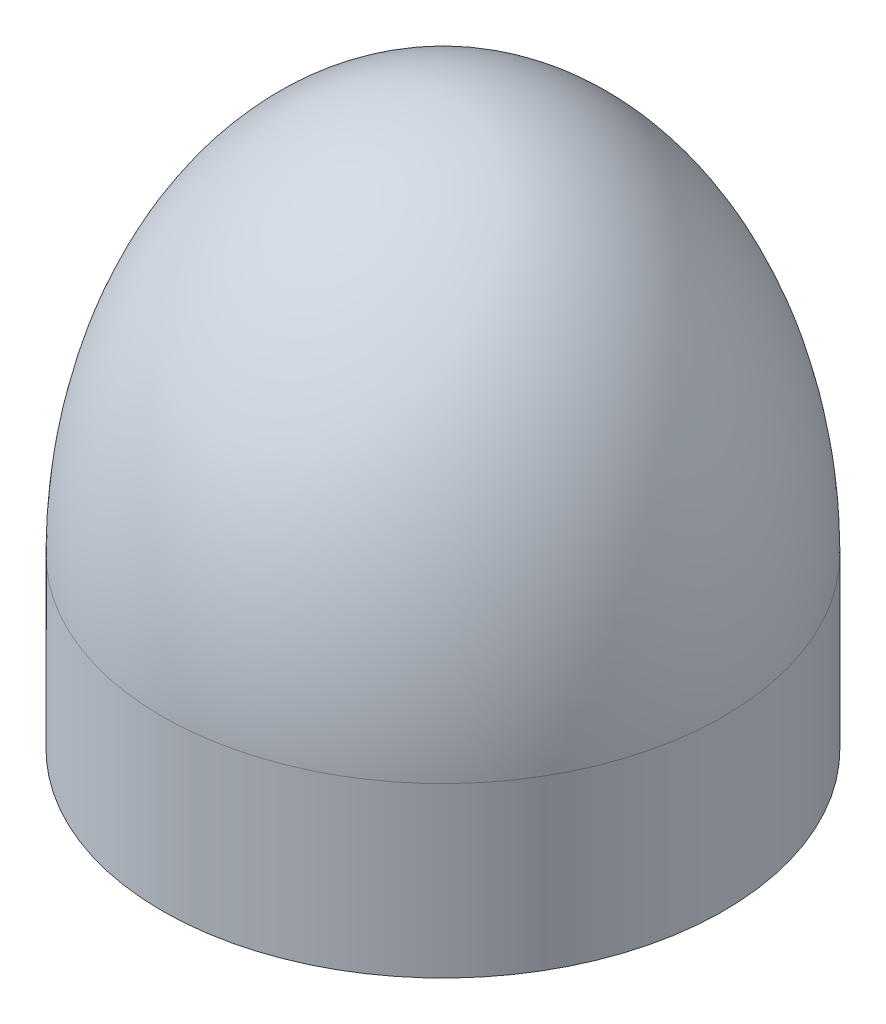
ISO-10303-21;
HEADER;
FILE_DESCRIPTION(('STEP AP214'),'2;1');
FILE_NAME('part.step','',(''),(''),'','','');
FILE_SCHEMA(('AUTOMOTIVE_DESIGN { 1 0 10303 214 1 1 1 1 }'));
ENDSEC;
DATA;
#1=APPLICATION_CONTEXT('core data for automotive mechanical design processes');
#2=APPLICATION_PROTOCOL_DEFINITION('international standard','automotive_design',2000,#1);
#3=PRODUCT_CONTEXT('',#1,'mechanical');
#4=PRODUCT('Part','Part','',(#3));
#5=PRODUCT_RELATED_PRODUCT_CATEGORY('part','',(#4));
#6=PRODUCT_DEFINITION_FORMATION('','',#4);
#7=PRODUCT_DEFINITION_CONTEXT('part definition',#1,'design');
#8=PRODUCT_DEFINITION('design','',#6,#7);
#9=PRODUCT_DEFINITION_SHAPE('','',#8);
#10=(LENGTH_UNIT() NAMED_UNIT(*) SI_UNIT(.MILLI.,.METRE.));
#11=(NAMED_UNIT(*) PLANE_ANGLE_UNIT() SI_UNIT($,.RADIAN.));
#12=(NAMED_UNIT(*) SI_UNIT($,.STERADIAN.) SOLID_ANGLE_UNIT());
#13=UNCERTAINTY_MEASURE_WITH_UNIT(LENGTH_MEASURE(1.E-05),#10,'distance_accuracy_value','');
#14=(GEOMETRIC_REPRESENTATION_CONTEXT(3) GLOBAL_UNCERTAINTY_ASSIGNED_CONTEXT((#13)) GLOBAL_UNIT_ASSIGNED_CONTEXT((#10,
#11,#12)) REPRESENTATION_CONTEXT('',''));
#15=CARTESIAN_POINT('',(0.,0.,0.));
#16=DIRECTION('',(0.,0.,1.));
#17=DIRECTION('',(1.,0.,0.));
#18=AXIS2_PLACEMENT_3D('',#15,#16,#17);
#19=CARTESIAN_POINT('',(0.,30.,0.));
#20=DIRECTION('',(0.,-1.,0.));
#21=DIRECTION('',(0.,0.,-1.));
#22=AXIS2_PLACEMENT_3D('',#19,#20,#21);
#23=CYLINDRICAL_SURFACE('',#22,50.);
#24=CARTESIAN_POINT('',(0.,30.,0.));
#25=DIRECTION('',(0.,1.,0.));
#26=DIRECTION('',(0.,0.,1.));
#27=AXIS2_PLACEMENT_3D('',#24,#25,#26);
#28=CIRCLE('',#27,50.);
#29=CARTESIAN_POINT('',(0.,30.,50.));
#30=VERTEX_POINT('',#29);
#31=EDGE_CURVE('E11',#30,#30,#28,.T.);
#32=ORIENTED_EDGE('',*,*,#31,.F.);
#33=EDGE_LOOP('',(#32));
#34=FACE_BOUND('',#33,.T.);
#35=CARTESIAN_POINT('',(0.,0.,0.));
#36=DIRECTION('',(0.,1.,0.));
#37=DIRECTION('',(0.,0.,1.));
#38=AXIS2_PLACEMENT_3D('',#35,#36,#37);
#39=CIRCLE('',#38,50.);
#40=CARTESIAN_POINT('',(0.,0.,50.));
#41=VERTEX_POINT('',#40);
#42=EDGE_CURVE('E41',#41,#41,#39,.T.);
#43=ORIENTED_EDGE('',*,*,#42,.T.);
#44=EDGE_LOOP('',(#43));
#45=FACE_BOUND('',#44,.T.);
#46=ADVANCED_FACE('F33',(#34,#45),#23,.T.);
#47=CARTESIAN_POINT('',(0.,30.,0.));
#48=DIRECTION('',(1.,0.,0.));
#49=DIRECTION('',(0.,1.,0.));
#50=AXIS2_PLACEMENT_3D('',#47,#48,#49);
#51=ELLIPSE('',#50,70.,50.);
#52=TRIMMED_CURVE('',#51,(PARAMETER_VALUE(0.)),(PARAMETER_VALUE(3.14159265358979)),.T.,.PARAMETER.);
#53=CARTESIAN_POINT('',(0.,-40.,0.));
#54=DIRECTION('',(0.,1.,0.));
#55=AXIS1_PLACEMENT('',#53,#54);
#56=SURFACE_OF_REVOLUTION('',#52,#55);
#57=CARTESIAN_POINT('',(0.,100.,0.));
#58=VERTEX_POINT('',#57);
#59=VERTEX_LOOP('',#58);
#60=FACE_BOUND('',#59,.T.);
#61=ORIENTED_EDGE('',*,*,#31,.T.);
#62=EDGE_LOOP('',(#61));
#63=FACE_BOUND('',#62,.T.);
#64=ADVANCED_FACE('F35',(#60,#63),#56,.F.);
#65=CARTESIAN_POINT('',(0.,0.,0.));
#66=DIRECTION('',(0.,1.,0.));
#67=DIRECTION('',(0.,0.,1.));
#68=AXIS2_PLACEMENT_3D('',#65,#66,#67);
#69=PLANE('',#68);
#70=ORIENTED_EDGE('',*,*,#42,.F.);
#71=EDGE_LOOP('',(#70));
#72=FACE_BOUND('',#71,.T.);
#73=ADVANCED_FACE('F46',(#72),#69,.F.);
#74=CLOSED_SHELL('',(#46,#64,#73));
#75=MANIFOLD_SOLID_BREP('B2',#74);
#76=ADVANCED_BREP_SHAPE_REPRESENTATION('',(#18,#75),#14);
#77=SHAPE_DEFINITION_REPRESENTATION(#9,#76);
ENDSEC;
END-ISO-10303-21;
